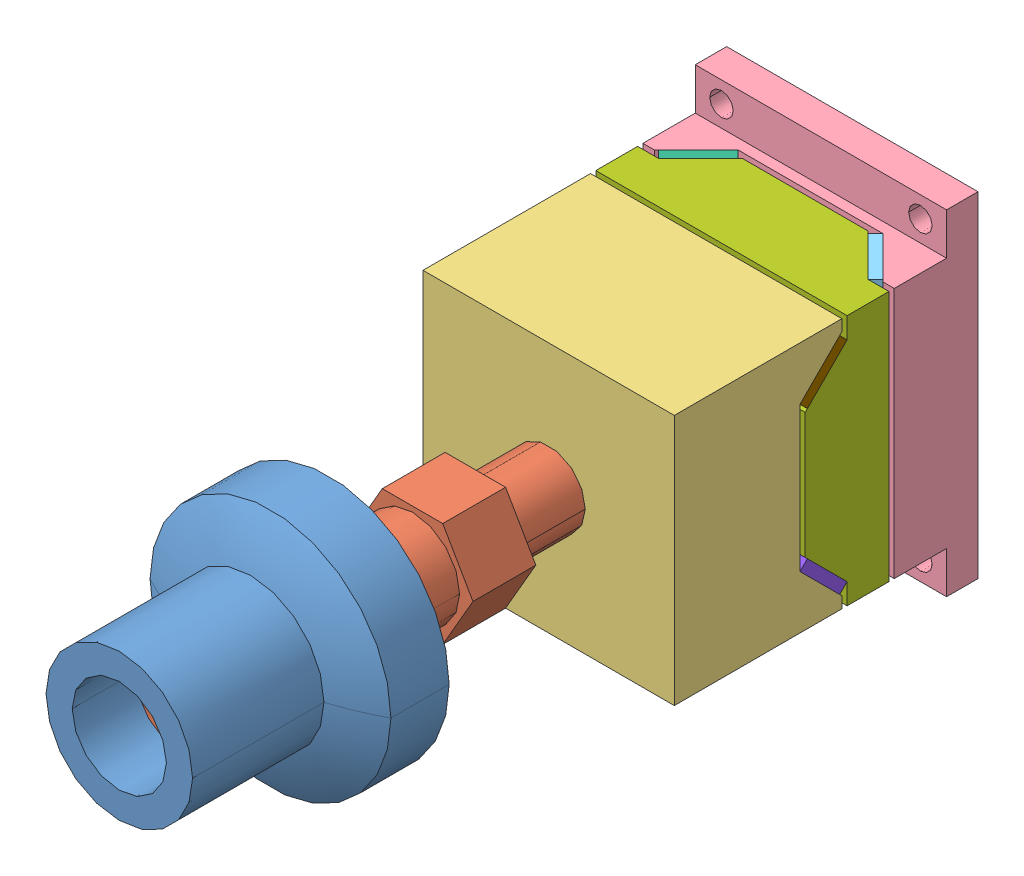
SolidWorks assembly Dewar Alignment Support, Right, OSIRIS.SLDASM, configuration Default (file format 5000). Lengths in mm.
Overall size (87.5 101.6 222.25).
9 component instances, 9 part files, 0 mates.
Components (placement in the parent):
- _U406-1: _U406.sldprt [Default] at (-1057.971 -395.3374 610.7386) size (87.5 91.4 67.41)
- _U372-1: _U372.sldprt [Default] at (-1057.971 -395.3374 547.2386) size (36.66 31.75 152.4)
- _U373-1: _U373.sldprt [Default] at (-1057.971 -395.3374 486.9136) size (76.2 76.2 50.8)
- _U379-1: _U379.sldprt [Default] at (-1057.971 -395.3374 432.9386) size (76.2 101.6 25.4)
- _U381-1: _U381.sldprt [Default] at (-1031.1196 -395.3374 440.0824) size (14.29 76.2 14.29)
- _U382-1: _U382.sldprt [Default] at (-1084.8223 -395.3374 440.0824) size (14.29 76.2 14.29)
- _U383-1: _U383.sldprt [Default] at (-1057.971 -395.3374 453.5761) size (76.2 76.2 38.1)
- _U384-1: _U384.sldprt [Default] at (-1057.971 -422.1888 467.0699) size (76.2 14.29 14.29)
- _U385-1: _U385.sldprt [Default] at (-1057.971 -368.4861 467.0699) size (76.2 14.29 14.29)
